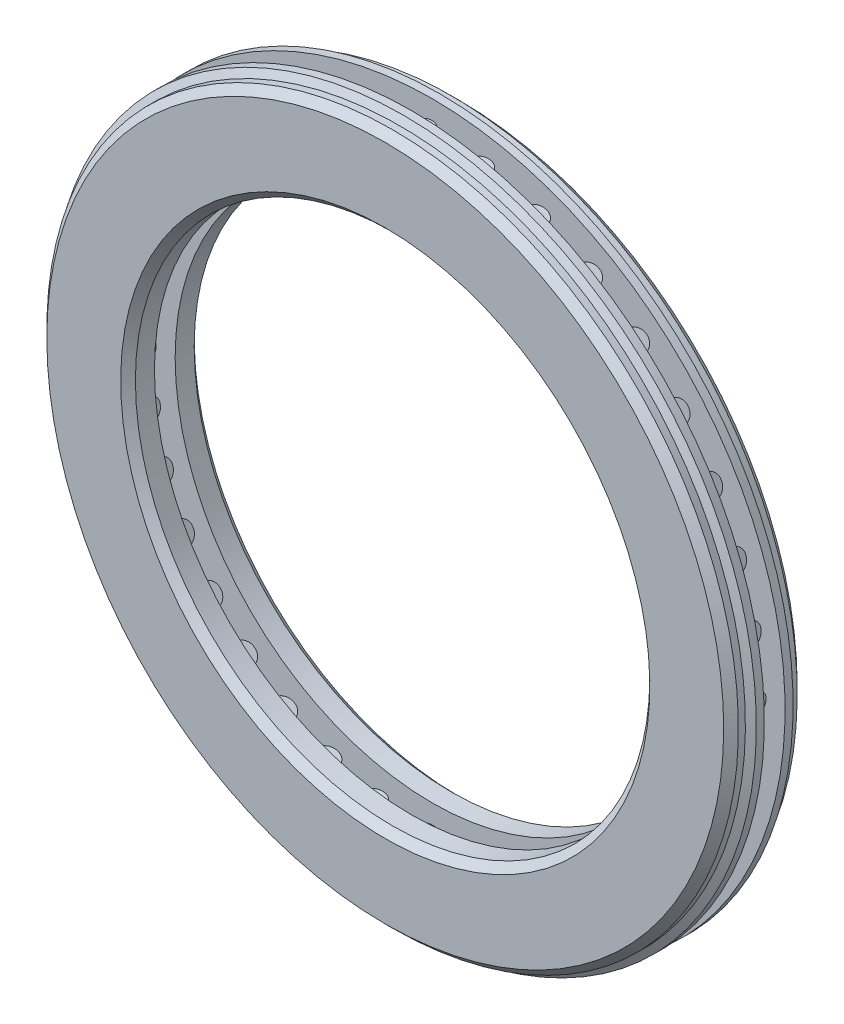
from build123d import *

# Parameters (mm, degrees)
BASESKE_W            = 1.428571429
BASESKE_H            = 7.8
CHAMFER1_SIZE        = 1
CIRPATTERNBALL_COUNT = 36


with BuildPart() as part:
    # BaseSke → Roller (revolve)
    with BuildSketch(Plane(origin=(0, 0, 0), x_dir=(0, 0, -1), z_dir=(1, 0, 0))):
        with Locations((-0.714285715, 41.5)):
            Rectangle(BASESKE_W, BASESKE_H)
    roller = revolve(axis=Axis((0, 129.521395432, 0), (0, -1, 0)))

    # ThrustPSke → ThrustPlates (revolve)
    with BuildSketch(Plane(origin=(0, 0, 0), x_dir=(0, 0, -1), z_dir=(1, 0, 0)), mode=Mode.PRIVATE) as thrustplates_sk:
        Polygon((-2.5, 48), (-1.408571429, 48), (-1.408571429, 35), (-5, 35), (-5, 47.054795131), (-3.045714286, 47.054795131), align=None)
        Polygon((5, 35), (1.408571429, 35), (1.408571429, 48), (2.5, 48), (3.045714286, 47.054795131), (5, 47.054795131), align=None)
    revolve(thrustplates_sk.sketch.rotate(Axis((0, 0, 10.13372637), (0, 0, -1)), 180), axis=Axis((0, 0, 10.13372637), (0, 0, -1)))

    # Chamfer1
    chamfer1_edges = [part.edges().sort_by_distance(p)[0] for p in [
        (0, 47.054795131, 5),
        (0, 35, 5),
        (0, 35, -5),
        (0, 47.054795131, -5),
    ]]
    chamfer(chamfer1_edges, length=CHAMFER1_SIZE)

    # CirPatternBall: Roller ×36 about axis
    cirpatternball_axis = Axis((0, 0, 0), (0, 0, 1))
    for i in range(1, CIRPATTERNBALL_COUNT):
        add(roller.rotate(cirpatternball_axis, i * 360 / CIRPATTERNBALL_COUNT))


solid = part.part
